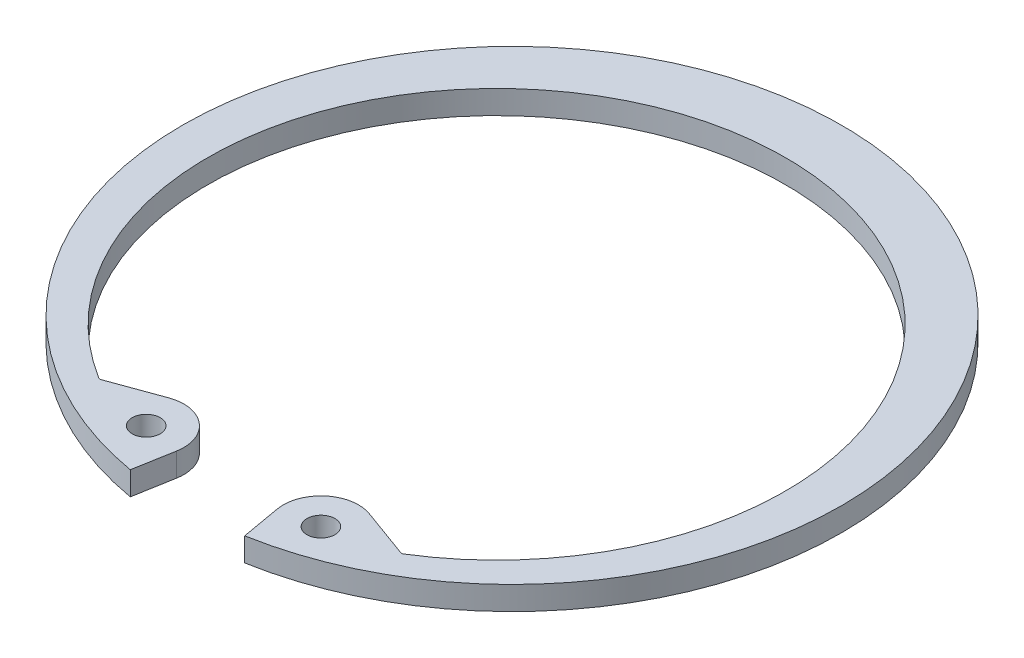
ISO-10303-21;
HEADER;
FILE_DESCRIPTION(('STEP AP214'),'2;1');
FILE_NAME('part.step','',(''),(''),'','','');
FILE_SCHEMA(('AUTOMOTIVE_DESIGN { 1 0 10303 214 1 1 1 1 }'));
ENDSEC;
DATA;
#1=APPLICATION_CONTEXT('core data for automotive mechanical design processes');
#2=APPLICATION_PROTOCOL_DEFINITION('international standard','automotive_design',2000,#1);
#3=PRODUCT_CONTEXT('',#1,'mechanical');
#4=PRODUCT('Part','Part','',(#3));
#5=PRODUCT_RELATED_PRODUCT_CATEGORY('part','',(#4));
#6=PRODUCT_DEFINITION_FORMATION('','',#4);
#7=PRODUCT_DEFINITION_CONTEXT('part definition',#1,'design');
#8=PRODUCT_DEFINITION('design','',#6,#7);
#9=PRODUCT_DEFINITION_SHAPE('','',#8);
#10=(LENGTH_UNIT() NAMED_UNIT(*) SI_UNIT(.MILLI.,.METRE.));
#11=(NAMED_UNIT(*) PLANE_ANGLE_UNIT() SI_UNIT($,.RADIAN.));
#12=(NAMED_UNIT(*) SI_UNIT($,.STERADIAN.) SOLID_ANGLE_UNIT());
#13=UNCERTAINTY_MEASURE_WITH_UNIT(LENGTH_MEASURE(1.E-05),#10,'distance_accuracy_value','');
#14=(GEOMETRIC_REPRESENTATION_CONTEXT(3) GLOBAL_UNCERTAINTY_ASSIGNED_CONTEXT((#13)) GLOBAL_UNIT_ASSIGNED_CONTEXT((#10,
#11,#12)) REPRESENTATION_CONTEXT('',''));
#15=CARTESIAN_POINT('',(0.,0.,0.));
#16=DIRECTION('',(0.,0.,1.));
#17=DIRECTION('',(1.,0.,0.));
#18=AXIS2_PLACEMENT_3D('',#15,#16,#17);
#19=CARTESIAN_POINT('',(7.36054001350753,-1.9812,23.4596004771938));
#20=DIRECTION('',(0.,1.,0.));
#21=DIRECTION('',(0.,0.,1.));
#22=AXIS2_PLACEMENT_3D('',#19,#20,#21);
#23=CYLINDRICAL_SURFACE('',#22,3.175);
#24=CARTESIAN_POINT('',(7.36054001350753,0.,23.4596004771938));
#25=DIRECTION('',(0.,1.,0.));
#26=DIRECTION('',(0.,0.,-1.));
#27=AXIS2_PLACEMENT_3D('',#24,#25,#26);
#28=CIRCLE('',#27,3.175);
#29=CARTESIAN_POINT('',(8.44645396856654,0.,20.4760764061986));
#30=VERTEX_POINT('',#29);
#31=CARTESIAN_POINT('',(4.23377539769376,0.,24.0109334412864));
#32=VERTEX_POINT('',#31);
#33=EDGE_CURVE('E137',#30,#32,#28,.T.);
#34=ORIENTED_EDGE('',*,*,#33,.F.);
#35=DIRECTION('',(0.,1.,0.));
#36=VECTOR('',#35,1.);
#37=CARTESIAN_POINT('',(8.44645396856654,-1.9812,20.4760764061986));
#38=LINE('',#37,#36);
#39=CARTESIAN_POINT('',(8.44645396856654,-1.9812,20.4760764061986));
#40=VERTEX_POINT('',#39);
#41=EDGE_CURVE('E114',#40,#30,#38,.T.);
#42=ORIENTED_EDGE('',*,*,#41,.F.);
#43=CARTESIAN_POINT('',(7.36054001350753,-1.9812,23.4596004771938));
#44=DIRECTION('',(0.,1.,0.));
#45=DIRECTION('',(0.,0.,-1.));
#46=AXIS2_PLACEMENT_3D('',#43,#44,#45);
#47=CIRCLE('',#46,3.175);
#48=CARTESIAN_POINT('',(4.23377539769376,-1.9812,24.0109334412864));
#49=VERTEX_POINT('',#48);
#50=EDGE_CURVE('E107',#40,#49,#47,.T.);
#51=ORIENTED_EDGE('',*,*,#50,.T.);
#52=DIRECTION('',(0.,1.,0.));
#53=VECTOR('',#52,1.);
#54=CARTESIAN_POINT('',(4.23377539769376,-1.9812,24.0109334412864));
#55=LINE('',#54,#53);
#56=EDGE_CURVE('E90',#49,#32,#55,.T.);
#57=ORIENTED_EDGE('',*,*,#56,.T.);
#58=EDGE_LOOP('',(#34,#42,#51,#57));
#59=FACE_BOUND('',#58,.T.);
#60=ADVANCED_FACE('F15',(#59),#23,.T.);
#61=CARTESIAN_POINT('',(12.7334227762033,-1.9812,22.0364054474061));
#62=DIRECTION('',(0.342020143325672,0.,-0.939692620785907));
#63=DIRECTION('',(-0.939692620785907,0.,-0.342020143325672));
#64=AXIS2_PLACEMENT_3D('',#61,#62,#63);
#65=PLANE('',#64);
#66=DIRECTION('',(-0.939692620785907,0.,-0.342020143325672));
#67=VECTOR('',#66,1.);
#68=CARTESIAN_POINT('',(12.7334227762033,0.,22.0364054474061));
#69=LINE('',#68,#67);
#70=CARTESIAN_POINT('',(12.6177949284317,0.,21.9943203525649));
#71=VERTEX_POINT('',#70);
#72=EDGE_CURVE('E115',#71,#30,#69,.T.);
#73=ORIENTED_EDGE('',*,*,#72,.F.);
#74=DIRECTION('',(0.,-1.,0.));
#75=VECTOR('',#74,1.);
#76=CARTESIAN_POINT('',(12.6177949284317,-1.9812,21.9943203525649));
#77=LINE('',#76,#75);
#78=CARTESIAN_POINT('',(12.6177949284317,-1.9812,21.9943203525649));
#79=VERTEX_POINT('',#78);
#80=EDGE_CURVE('E30',#71,#79,#77,.T.);
#81=ORIENTED_EDGE('',*,*,#80,.T.);
#82=DIRECTION('',(-0.939692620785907,0.,-0.342020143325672));
#83=VECTOR('',#82,1.);
#84=CARTESIAN_POINT('',(12.7334227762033,-1.9812,22.0364054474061));
#85=LINE('',#84,#83);
#86=EDGE_CURVE('E101',#79,#40,#85,.T.);
#87=ORIENTED_EDGE('',*,*,#86,.T.);
#88=ORIENTED_EDGE('',*,*,#41,.T.);
#89=EDGE_LOOP('',(#73,#81,#87,#88));
#90=FACE_BOUND('',#89,.T.);
#91=ADVANCED_FACE('F192',(#90),#65,.T.);
#92=CARTESIAN_POINT('',(0.,-1.9812,1.29789300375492));
#93=DIRECTION('',(0.,1.,0.));
#94=DIRECTION('',(0.,0.,1.));
#95=AXIS2_PLACEMENT_3D('',#92,#93,#94);
#96=CYLINDRICAL_SURFACE('',#95,24.3356930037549);
#97=CARTESIAN_POINT('',(0.,0.,1.29789300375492));
#98=DIRECTION('',(0.,-1.,0.));
#99=DIRECTION('',(0.,0.,1.));
#100=AXIS2_PLACEMENT_3D('',#97,#98,#99);
#101=CIRCLE('',#100,24.3356930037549);
#102=CARTESIAN_POINT('',(-12.838669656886,0.,21.9714150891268));
#103=VERTEX_POINT('',#102);
#104=CARTESIAN_POINT('',(12.8386696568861,0.,21.9714150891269));
#105=VERTEX_POINT('',#104);
#106=EDGE_CURVE('E117',#103,#105,#101,.T.);
#107=ORIENTED_EDGE('',*,*,#106,.F.);
#108=DIRECTION('',(0.,1.,0.));
#109=VECTOR('',#108,1.);
#110=CARTESIAN_POINT('',(-12.838669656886,-1.9812,21.9714150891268));
#111=LINE('',#110,#109);
#112=CARTESIAN_POINT('',(-12.838669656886,-1.9812,21.9714150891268));
#113=VERTEX_POINT('',#112);
#114=EDGE_CURVE('E168',#103,#113,#111,.F.);
#115=ORIENTED_EDGE('',*,*,#114,.T.);
#116=CARTESIAN_POINT('',(0.,-1.9812,1.29789300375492));
#117=DIRECTION('',(0.,-1.,0.));
#118=DIRECTION('',(0.,0.,1.));
#119=AXIS2_PLACEMENT_3D('',#116,#117,#118);
#120=CIRCLE('',#119,24.3356930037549);
#121=CARTESIAN_POINT('',(12.8386696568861,-1.9812,21.9714150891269));
#122=VERTEX_POINT('',#121);
#123=EDGE_CURVE('E133',#113,#122,#120,.T.);
#124=ORIENTED_EDGE('',*,*,#123,.T.);
#125=DIRECTION('',(0.,1.,0.));
#126=VECTOR('',#125,1.);
#127=CARTESIAN_POINT('',(12.8386696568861,-1.9812,21.9714150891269));
#128=LINE('',#127,#126);
#129=EDGE_CURVE('E165',#122,#105,#128,.T.);
#130=ORIENTED_EDGE('',*,*,#129,.T.);
#131=EDGE_LOOP('',(#107,#115,#124,#130));
#132=FACE_BOUND('',#131,.T.);
#133=ADVANCED_FACE('F188',(#132),#96,.F.);
#134=CARTESIAN_POINT('',(-12.7334227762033,-1.9812,22.0364054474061));
#135=DIRECTION('',(-0.342020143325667,0.,-0.939692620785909));
#136=DIRECTION('',(-0.939692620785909,0.,0.342020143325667));
#137=AXIS2_PLACEMENT_3D('',#134,#135,#136);
#138=PLANE('',#137);
#139=DIRECTION('',(-0.939692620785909,0.,0.342020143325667));
#140=VECTOR('',#139,1.);
#141=CARTESIAN_POINT('',(-12.7334227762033,-1.9812,22.0364054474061));
#142=LINE('',#141,#140);
#143=CARTESIAN_POINT('',(-8.44645396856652,-1.9812,20.4760764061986));
#144=VERTEX_POINT('',#143);
#145=CARTESIAN_POINT('',(-12.6177949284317,-1.9812,21.9943203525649));
#146=VERTEX_POINT('',#145);
#147=EDGE_CURVE('E130',#144,#146,#142,.T.);
#148=ORIENTED_EDGE('',*,*,#147,.T.);
#149=DIRECTION('',(0.,-1.,0.));
#150=VECTOR('',#149,1.);
#151=CARTESIAN_POINT('',(-12.6177949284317,0.,21.9943203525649));
#152=LINE('',#151,#150);
#153=CARTESIAN_POINT('',(-12.6177949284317,0.,21.9943203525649));
#154=VERTEX_POINT('',#153);
#155=EDGE_CURVE('E155',#146,#154,#152,.F.);
#156=ORIENTED_EDGE('',*,*,#155,.T.);
#157=DIRECTION('',(-0.939692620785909,0.,0.342020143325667));
#158=VECTOR('',#157,1.);
#159=CARTESIAN_POINT('',(-12.7334227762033,0.,22.0364054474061));
#160=LINE('',#159,#158);
#161=CARTESIAN_POINT('',(-8.44645396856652,0.,20.4760764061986));
#162=VERTEX_POINT('',#161);
#163=EDGE_CURVE('E150',#162,#154,#160,.T.);
#164=ORIENTED_EDGE('',*,*,#163,.F.);
#165=DIRECTION('',(0.,1.,0.));
#166=VECTOR('',#165,1.);
#167=CARTESIAN_POINT('',(-8.44645396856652,-1.9812,20.4760764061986));
#168=LINE('',#167,#166);
#169=EDGE_CURVE('E156',#144,#162,#168,.T.);
#170=ORIENTED_EDGE('',*,*,#169,.F.);
#171=EDGE_LOOP('',(#148,#156,#164,#170));
#172=FACE_BOUND('',#171,.T.);
#173=ADVANCED_FACE('F182',(#172),#138,.T.);
#174=CARTESIAN_POINT('',(-7.36054001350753,-1.9812,23.4596004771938));
#175=DIRECTION('',(0.,1.,0.));
#176=DIRECTION('',(0.,0.,1.));
#177=AXIS2_PLACEMENT_3D('',#174,#175,#176);
#178=CYLINDRICAL_SURFACE('',#177,3.175);
#179=CARTESIAN_POINT('',(-7.36054001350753,0.,23.4596004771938));
#180=DIRECTION('',(0.,1.,0.));
#181=DIRECTION('',(0.,0.,1.));
#182=AXIS2_PLACEMENT_3D('',#179,#180,#181);
#183=CIRCLE('',#182,3.175);
#184=CARTESIAN_POINT('',(-4.23377539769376,0.,24.0109334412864));
#185=VERTEX_POINT('',#184);
#186=EDGE_CURVE('E147',#185,#162,#183,.T.);
#187=ORIENTED_EDGE('',*,*,#186,.F.);
#188=DIRECTION('',(0.,1.,0.));
#189=VECTOR('',#188,1.);
#190=CARTESIAN_POINT('',(-4.23377539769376,-1.9812,24.0109334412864));
#191=LINE('',#190,#189);
#192=CARTESIAN_POINT('',(-4.23377539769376,-1.9812,24.0109334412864));
#193=VERTEX_POINT('',#192);
#194=EDGE_CURVE('E158',#193,#185,#191,.T.);
#195=ORIENTED_EDGE('',*,*,#194,.F.);
#196=CARTESIAN_POINT('',(-7.36054001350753,-1.9812,23.4596004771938));
#197=DIRECTION('',(0.,1.,0.));
#198=DIRECTION('',(0.,0.,1.));
#199=AXIS2_PLACEMENT_3D('',#196,#197,#198);
#200=CIRCLE('',#199,3.175);
#201=EDGE_CURVE('E127',#193,#144,#200,.T.);
#202=ORIENTED_EDGE('',*,*,#201,.T.);
#203=ORIENTED_EDGE('',*,*,#169,.T.);
#204=EDGE_LOOP('',(#187,#195,#202,#203));
#205=FACE_BOUND('',#204,.T.);
#206=ADVANCED_FACE('F201',(#205),#178,.T.);
#207=CARTESIAN_POINT('',(-4.82085543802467,-1.9812,27.3404298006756));
#208=DIRECTION('',(0.984807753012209,0.,0.173648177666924));
#209=DIRECTION('',(0.173648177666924,0.,-0.984807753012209));
#210=AXIS2_PLACEMENT_3D('',#207,#208,#209);
#211=PLANE('',#210);
#212=DIRECTION('',(0.173648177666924,0.,-0.984807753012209));
#213=VECTOR('',#212,1.);
#214=CARTESIAN_POINT('',(-4.82085543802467,0.,27.3404298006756));
#215=LINE('',#214,#213);
#216=CARTESIAN_POINT('',(-4.82085543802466,0.,27.3404298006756));
#217=VERTEX_POINT('',#216);
#218=EDGE_CURVE('E144',#217,#185,#215,.T.);
#219=ORIENTED_EDGE('',*,*,#218,.F.);
#220=DIRECTION('',(0.,1.,0.));
#221=VECTOR('',#220,1.);
#222=CARTESIAN_POINT('',(-4.82085543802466,-1.9812,27.3404298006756));
#223=LINE('',#222,#221);
#224=CARTESIAN_POINT('',(-4.82085543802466,-1.9812,27.3404298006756));
#225=VERTEX_POINT('',#224);
#226=EDGE_CURVE('E160',#225,#217,#223,.T.);
#227=ORIENTED_EDGE('',*,*,#226,.F.);
#228=DIRECTION('',(0.173648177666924,0.,-0.984807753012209));
#229=VECTOR('',#228,1.);
#230=CARTESIAN_POINT('',(-4.82085543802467,-1.9812,27.3404298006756));
#231=LINE('',#230,#229);
#232=EDGE_CURVE('E124',#225,#193,#231,.T.);
#233=ORIENTED_EDGE('',*,*,#232,.T.);
#234=ORIENTED_EDGE('',*,*,#194,.T.);
#235=EDGE_LOOP('',(#219,#227,#233,#234));
#236=FACE_BOUND('',#235,.T.);
#237=ADVANCED_FACE('F198',(#236),#211,.T.);
#238=CARTESIAN_POINT('',(0.,-1.9812,0.));
#239=DIRECTION('',(0.,1.,0.));
#240=DIRECTION('',(0.,0.,1.));
#241=AXIS2_PLACEMENT_3D('',#238,#239,#240);
#242=CYLINDRICAL_SURFACE('',#241,27.7622);
#243=CARTESIAN_POINT('',(0.,0.,0.));
#244=DIRECTION('',(0.,1.,0.));
#245=DIRECTION('',(0.,0.,1.));
#246=AXIS2_PLACEMENT_3D('',#243,#244,#245);
#247=CIRCLE('',#246,27.7622);
#248=CARTESIAN_POINT('',(4.82085543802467,0.,27.3404298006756));
#249=VERTEX_POINT('',#248);
#250=EDGE_CURVE('E141',#249,#217,#247,.T.);
#251=ORIENTED_EDGE('',*,*,#250,.F.);
#252=DIRECTION('',(0.,1.,0.));
#253=VECTOR('',#252,1.);
#254=CARTESIAN_POINT('',(4.82085543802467,-1.9812,27.3404298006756));
#255=LINE('',#254,#253);
#256=CARTESIAN_POINT('',(4.82085543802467,-1.9812,27.3404298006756));
#257=VERTEX_POINT('',#256);
#258=EDGE_CURVE('E100',#257,#249,#255,.T.);
#259=ORIENTED_EDGE('',*,*,#258,.F.);
#260=CARTESIAN_POINT('',(0.,-1.9812,0.));
#261=DIRECTION('',(0.,1.,0.));
#262=DIRECTION('',(0.,0.,1.));
#263=AXIS2_PLACEMENT_3D('',#260,#261,#262);
#264=CIRCLE('',#263,27.7622);
#265=EDGE_CURVE('E110',#257,#225,#264,.T.);
#266=ORIENTED_EDGE('',*,*,#265,.T.);
#267=ORIENTED_EDGE('',*,*,#226,.T.);
#268=EDGE_LOOP('',(#251,#259,#266,#267));
#269=FACE_BOUND('',#268,.T.);
#270=ADVANCED_FACE('F196',(#269),#242,.T.);
#271=CARTESIAN_POINT('',(4.82085543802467,-1.9812,27.3404298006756));
#272=DIRECTION('',(-0.984807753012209,0.,0.173648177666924));
#273=DIRECTION('',(0.173648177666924,0.,0.984807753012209));
#274=AXIS2_PLACEMENT_3D('',#271,#272,#273);
#275=PLANE('',#274);
#276=DIRECTION('',(0.173648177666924,0.,0.984807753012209));
#277=VECTOR('',#276,1.);
#278=CARTESIAN_POINT('',(4.82085543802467,0.,27.3404298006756));
#279=LINE('',#278,#277);
#280=EDGE_CURVE('E95',#32,#249,#279,.T.);
#281=ORIENTED_EDGE('',*,*,#280,.F.);
#282=ORIENTED_EDGE('',*,*,#56,.F.);
#283=DIRECTION('',(0.173648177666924,0.,0.984807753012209));
#284=VECTOR('',#283,1.);
#285=CARTESIAN_POINT('',(4.82085543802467,-1.9812,27.3404298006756));
#286=LINE('',#285,#284);
#287=EDGE_CURVE('E93',#49,#257,#286,.T.);
#288=ORIENTED_EDGE('',*,*,#287,.T.);
#289=ORIENTED_EDGE('',*,*,#258,.T.);
#290=EDGE_LOOP('',(#281,#282,#288,#289));
#291=FACE_BOUND('',#290,.T.);
#292=ADVANCED_FACE('F92',(#291),#275,.T.);
#293=CARTESIAN_POINT('',(7.36054001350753,-1.9812,23.4596004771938));
#294=DIRECTION('',(0.,-1.,0.));
#295=DIRECTION('',(0.,0.,-1.));
#296=AXIS2_PLACEMENT_3D('',#293,#294,#295);
#297=PLANE('',#296);
#298=CARTESIAN_POINT('',(-7.36054001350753,-1.9812,23.4596004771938));
#299=DIRECTION('',(0.,1.,0.));
#300=DIRECTION('',(0.,0.,1.));
#301=AXIS2_PLACEMENT_3D('',#298,#299,#300);
#302=CIRCLE('',#301,1.1811);
#303=CARTESIAN_POINT('',(-7.36054001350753,-1.9812,24.6407004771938));
#304=VERTEX_POINT('',#303);
#305=EDGE_CURVE('E335',#304,#304,#302,.T.);
#306=ORIENTED_EDGE('',*,*,#305,.T.);
#307=EDGE_LOOP('',(#306));
#308=FACE_BOUND('',#307,.T.);
#309=CARTESIAN_POINT('',(7.36054001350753,-1.9812,23.4596004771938));
#310=DIRECTION('',(0.,1.,0.));
#311=DIRECTION('',(0.,0.,1.));
#312=AXIS2_PLACEMENT_3D('',#309,#310,#311);
#313=CIRCLE('',#312,1.1811);
#314=CARTESIAN_POINT('',(7.36054001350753,-1.9812,24.6407004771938));
#315=VERTEX_POINT('',#314);
#316=EDGE_CURVE('E139',#315,#315,#313,.T.);
#317=ORIENTED_EDGE('',*,*,#316,.T.);
#318=EDGE_LOOP('',(#317));
#319=FACE_BOUND('',#318,.T.);
#320=ORIENTED_EDGE('',*,*,#50,.F.);
#321=ORIENTED_EDGE('',*,*,#86,.F.);
#322=CARTESIAN_POINT('',(12.7046680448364,-1.9812,21.7556384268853));
#323=DIRECTION('',(0.,-1.,0.));
#324=DIRECTION('',(0.,0.,-1.));
#325=AXIS2_PLACEMENT_3D('',#322,#323,#324);
#326=CIRCLE('',#325,0.254);
#327=EDGE_CURVE('E10',#79,#122,#326,.F.);
#328=ORIENTED_EDGE('',*,*,#327,.T.);
#329=ORIENTED_EDGE('',*,*,#123,.F.);
#330=CARTESIAN_POINT('',(-12.7046680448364,-1.9812,21.7556384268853));
#331=DIRECTION('',(0.,-1.,0.));
#332=DIRECTION('',(0.,0.,-1.));
#333=AXIS2_PLACEMENT_3D('',#330,#331,#332);
#334=CIRCLE('',#333,0.254);
#335=EDGE_CURVE('E173',#113,#146,#334,.F.);
#336=ORIENTED_EDGE('',*,*,#335,.T.);
#337=ORIENTED_EDGE('',*,*,#147,.F.);
#338=ORIENTED_EDGE('',*,*,#201,.F.);
#339=ORIENTED_EDGE('',*,*,#232,.F.);
#340=ORIENTED_EDGE('',*,*,#265,.F.);
#341=ORIENTED_EDGE('',*,*,#287,.F.);
#342=EDGE_LOOP('',(#320,#321,#328,#329,#336,#337,#338,#339,#340,#341));
#343=FACE_BOUND('',#342,.T.);
#344=ADVANCED_FACE('F106',(#308,#319,#343),#297,.T.);
#345=CARTESIAN_POINT('',(7.36054001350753,0.,23.4596004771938));
#346=DIRECTION('',(0.,-1.,0.));
#347=DIRECTION('',(0.,0.,-1.));
#348=AXIS2_PLACEMENT_3D('',#345,#346,#347);
#349=PLANE('',#348);
#350=CARTESIAN_POINT('',(-7.36054001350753,0.,23.4596004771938));
#351=DIRECTION('',(0.,1.,0.));
#352=DIRECTION('',(0.,0.,1.));
#353=AXIS2_PLACEMENT_3D('',#350,#351,#352);
#354=CIRCLE('',#353,1.1811);
#355=CARTESIAN_POINT('',(-7.36054001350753,0.,24.6407004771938));
#356=VERTEX_POINT('',#355);
#357=EDGE_CURVE('E331',#356,#356,#354,.T.);
#358=ORIENTED_EDGE('',*,*,#357,.F.);
#359=EDGE_LOOP('',(#358));
#360=FACE_BOUND('',#359,.T.);
#361=CARTESIAN_POINT('',(7.36054001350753,0.,23.4596004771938));
#362=DIRECTION('',(0.,1.,0.));
#363=DIRECTION('',(0.,0.,1.));
#364=AXIS2_PLACEMENT_3D('',#361,#362,#363);
#365=CIRCLE('',#364,1.1811);
#366=CARTESIAN_POINT('',(7.36054001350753,0.,24.6407004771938));
#367=VERTEX_POINT('',#366);
#368=EDGE_CURVE('E120',#367,#367,#365,.T.);
#369=ORIENTED_EDGE('',*,*,#368,.F.);
#370=EDGE_LOOP('',(#369));
#371=FACE_BOUND('',#370,.T.);
#372=ORIENTED_EDGE('',*,*,#33,.T.);
#373=ORIENTED_EDGE('',*,*,#280,.T.);
#374=ORIENTED_EDGE('',*,*,#250,.T.);
#375=ORIENTED_EDGE('',*,*,#218,.T.);
#376=ORIENTED_EDGE('',*,*,#186,.T.);
#377=ORIENTED_EDGE('',*,*,#163,.T.);
#378=CARTESIAN_POINT('',(-12.7046680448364,0.,21.7556384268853));
#379=DIRECTION('',(0.,-1.,0.));
#380=DIRECTION('',(0.,0.,-1.));
#381=AXIS2_PLACEMENT_3D('',#378,#379,#380);
#382=CIRCLE('',#381,0.254);
#383=EDGE_CURVE('E171',#154,#103,#382,.T.);
#384=ORIENTED_EDGE('',*,*,#383,.T.);
#385=ORIENTED_EDGE('',*,*,#106,.T.);
#386=CARTESIAN_POINT('',(12.7046680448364,0.,21.7556384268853));
#387=DIRECTION('',(0.,-1.,0.));
#388=DIRECTION('',(0.,0.,-1.));
#389=AXIS2_PLACEMENT_3D('',#386,#387,#388);
#390=CIRCLE('',#389,0.254);
#391=EDGE_CURVE('E23',#105,#71,#390,.T.);
#392=ORIENTED_EDGE('',*,*,#391,.T.);
#393=ORIENTED_EDGE('',*,*,#72,.T.);
#394=EDGE_LOOP('',(#372,#373,#374,#375,#376,#377,#384,#385,#392,#393));
#395=FACE_BOUND('',#394,.T.);
#396=ADVANCED_FACE('F186',(#360,#371,#395),#349,.F.);
#397=CARTESIAN_POINT('',(7.36054001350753,-1.9812,23.4596004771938));
#398=DIRECTION('',(0.,1.,0.));
#399=DIRECTION('',(0.,0.,1.));
#400=AXIS2_PLACEMENT_3D('',#397,#398,#399);
#401=CYLINDRICAL_SURFACE('',#400,1.1811);
#402=ORIENTED_EDGE('',*,*,#316,.F.);
#403=EDGE_LOOP('',(#402));
#404=FACE_BOUND('',#403,.T.);
#405=ORIENTED_EDGE('',*,*,#368,.T.);
#406=EDGE_LOOP('',(#405));
#407=FACE_BOUND('',#406,.T.);
#408=ADVANCED_FACE('F228',(#404,#407),#401,.F.);
#409=CARTESIAN_POINT('',(-7.36054001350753,-1.9812,23.4596004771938));
#410=DIRECTION('',(0.,1.,0.));
#411=DIRECTION('',(0.,0.,1.));
#412=AXIS2_PLACEMENT_3D('',#409,#410,#411);
#413=CYLINDRICAL_SURFACE('',#412,1.1811);
#414=ORIENTED_EDGE('',*,*,#305,.F.);
#415=EDGE_LOOP('',(#414));
#416=FACE_BOUND('',#415,.T.);
#417=ORIENTED_EDGE('',*,*,#357,.T.);
#418=EDGE_LOOP('',(#417));
#419=FACE_BOUND('',#418,.T.);
#420=ADVANCED_FACE('F222',(#416,#419),#413,.F.);
#421=CARTESIAN_POINT('',(-12.7046680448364,-1.9812,21.7556384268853));
#422=DIRECTION('',(0.,1.,0.));
#423=DIRECTION('',(0.,0.,1.));
#424=AXIS2_PLACEMENT_3D('',#421,#422,#423);
#425=CYLINDRICAL_SURFACE('',#424,0.254);
#426=ORIENTED_EDGE('',*,*,#335,.F.);
#427=ORIENTED_EDGE('',*,*,#114,.F.);
#428=ORIENTED_EDGE('',*,*,#383,.F.);
#429=ORIENTED_EDGE('',*,*,#155,.F.);
#430=EDGE_LOOP('',(#426,#427,#428,#429));
#431=FACE_BOUND('',#430,.T.);
#432=ADVANCED_FACE('F184',(#431),#425,.F.);
#433=CARTESIAN_POINT('',(12.7046680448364,-1.9812,21.7556384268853));
#434=DIRECTION('',(0.,1.,0.));
#435=DIRECTION('',(0.,0.,1.));
#436=AXIS2_PLACEMENT_3D('',#433,#434,#435);
#437=CYLINDRICAL_SURFACE('',#436,0.254);
#438=ORIENTED_EDGE('',*,*,#327,.F.);
#439=ORIENTED_EDGE('',*,*,#80,.F.);
#440=ORIENTED_EDGE('',*,*,#391,.F.);
#441=ORIENTED_EDGE('',*,*,#129,.F.);
#442=EDGE_LOOP('',(#438,#439,#440,#441));
#443=FACE_BOUND('',#442,.T.);
#444=ADVANCED_FACE('F17',(#443),#437,.F.);
#445=CLOSED_SHELL('',(#60,#91,#133,#173,#206,#237,#270,#292,#344,#396,#408,#420,#432,#444));
#446=MANIFOLD_SOLID_BREP('B1',#445);
#447=ADVANCED_BREP_SHAPE_REPRESENTATION('',(#18,#446),#14);
#448=SHAPE_DEFINITION_REPRESENTATION(#9,#447);
ENDSEC;
END-ISO-10303-21;
